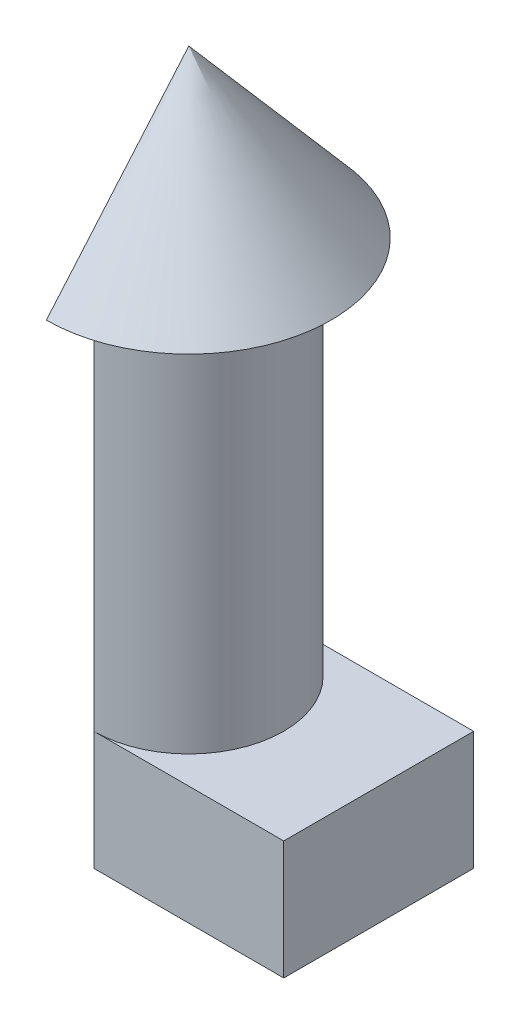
ISO-10303-21;
HEADER;
FILE_DESCRIPTION(('STEP AP214'),'2;1');
FILE_NAME('part.step','',(''),(''),'','','');
FILE_SCHEMA(('AUTOMOTIVE_DESIGN { 1 0 10303 214 1 1 1 1 }'));
ENDSEC;
DATA;
#1=APPLICATION_CONTEXT('core data for automotive mechanical design processes');
#2=APPLICATION_PROTOCOL_DEFINITION('international standard','automotive_design',2000,#1);
#3=PRODUCT_CONTEXT('',#1,'mechanical');
#4=PRODUCT('Part','Part','',(#3));
#5=PRODUCT_RELATED_PRODUCT_CATEGORY('part','',(#4));
#6=PRODUCT_DEFINITION_FORMATION('','',#4);
#7=PRODUCT_DEFINITION_CONTEXT('part definition',#1,'design');
#8=PRODUCT_DEFINITION('design','',#6,#7);
#9=PRODUCT_DEFINITION_SHAPE('','',#8);
#10=(LENGTH_UNIT() NAMED_UNIT(*) SI_UNIT(.MILLI.,.METRE.));
#11=(NAMED_UNIT(*) PLANE_ANGLE_UNIT() SI_UNIT($,.RADIAN.));
#12=(NAMED_UNIT(*) SI_UNIT($,.STERADIAN.) SOLID_ANGLE_UNIT());
#13=UNCERTAINTY_MEASURE_WITH_UNIT(LENGTH_MEASURE(1.E-05),#10,'distance_accuracy_value','');
#14=(GEOMETRIC_REPRESENTATION_CONTEXT(3) GLOBAL_UNCERTAINTY_ASSIGNED_CONTEXT((#13)) GLOBAL_UNIT_ASSIGNED_CONTEXT((#10,
#11,#12)) REPRESENTATION_CONTEXT('',''));
#15=CARTESIAN_POINT('',(0.,0.,0.));
#16=DIRECTION('',(0.,0.,1.));
#17=DIRECTION('',(1.,0.,0.));
#18=AXIS2_PLACEMENT_3D('',#15,#16,#17);
#19=CARTESIAN_POINT('',(0.,23.,0.));
#20=DIRECTION('',(0.,1.,0.));
#21=DIRECTION('',(-1.,0.,0.));
#22=AXIS2_PLACEMENT_3D('',#19,#20,#21);
#23=CYLINDRICAL_SURFACE('',#22,4.);
#24=DIRECTION('',(0.,1.,0.));
#25=VECTOR('',#24,1.);
#26=CARTESIAN_POINT('',(0.,23.,4.));
#27=LINE('',#26,#25);
#28=CARTESIAN_POINT('',(0.,0.,4.));
#29=VERTEX_POINT('',#28);
#30=CARTESIAN_POINT('',(0.,16.,4.));
#31=VERTEX_POINT('',#30);
#32=EDGE_CURVE('E122',#29,#31,#27,.T.);
#33=ORIENTED_EDGE('',*,*,#32,.F.);
#34=CARTESIAN_POINT('',(0.,0.,0.));
#35=DIRECTION('',(0.,1.,0.));
#36=DIRECTION('',(-1.,0.,0.));
#37=AXIS2_PLACEMENT_3D('',#34,#35,#36);
#38=CIRCLE('',#37,4.);
#39=CARTESIAN_POINT('',(0.,0.,-4.));
#40=VERTEX_POINT('',#39);
#41=EDGE_CURVE('E130',#29,#40,#38,.T.);
#42=ORIENTED_EDGE('',*,*,#41,.T.);
#43=DIRECTION('',(0.,1.,0.));
#44=VECTOR('',#43,1.);
#45=CARTESIAN_POINT('',(0.,23.,-4.));
#46=LINE('',#45,#44);
#47=CARTESIAN_POINT('',(0.,16.,-4.));
#48=VERTEX_POINT('',#47);
#49=EDGE_CURVE('E120',#48,#40,#46,.F.);
#50=ORIENTED_EDGE('',*,*,#49,.F.);
#51=CARTESIAN_POINT('',(0.,16.,0.));
#52=DIRECTION('',(0.,1.,0.));
#53=DIRECTION('',(-1.,0.,0.));
#54=AXIS2_PLACEMENT_3D('',#51,#52,#53);
#55=CIRCLE('',#54,4.);
#56=EDGE_CURVE('E127',#31,#48,#55,.T.);
#57=ORIENTED_EDGE('',*,*,#56,.F.);
#58=EDGE_LOOP('',(#33,#42,#50,#57));
#59=FACE_BOUND('',#58,.T.);
#60=ADVANCED_FACE('F35',(#59),#23,.T.);
#61=CARTESIAN_POINT('',(4.,16.,0.));
#62=DIRECTION('',(0.,1.,0.));
#63=DIRECTION('',(-1.,0.,0.));
#64=AXIS2_PLACEMENT_3D('',#61,#62,#63);
#65=PLANE('',#64);
#66=DIRECTION('',(0.,0.,1.));
#67=VECTOR('',#66,1.);
#68=CARTESIAN_POINT('',(0.,16.,0.));
#69=LINE('',#68,#67);
#70=CARTESIAN_POINT('',(0.,16.,-6.));
#71=VERTEX_POINT('',#70);
#72=EDGE_CURVE('E55',#71,#48,#69,.T.);
#73=ORIENTED_EDGE('',*,*,#72,.F.);
#74=CARTESIAN_POINT('',(0.,16.,0.));
#75=DIRECTION('',(0.,1.,0.));
#76=DIRECTION('',(-1.,0.,0.));
#77=AXIS2_PLACEMENT_3D('',#74,#75,#76);
#78=CIRCLE('',#77,6.);
#79=CARTESIAN_POINT('',(0.,16.,6.));
#80=VERTEX_POINT('',#79);
#81=EDGE_CURVE('E124',#80,#71,#78,.T.);
#82=ORIENTED_EDGE('',*,*,#81,.F.);
#83=EDGE_CURVE('E49',#31,#80,#69,.T.);
#84=ORIENTED_EDGE('',*,*,#83,.F.);
#85=ORIENTED_EDGE('',*,*,#56,.T.);
#86=EDGE_LOOP('',(#73,#82,#84,#85));
#87=FACE_BOUND('',#86,.T.);
#88=ADVANCED_FACE('F137',(#87),#65,.F.);
#89=CARTESIAN_POINT('',(0.,16.,0.));
#90=DIRECTION('',(0.,-1.,0.));
#91=DIRECTION('',(1.,0.,0.));
#92=AXIS2_PLACEMENT_3D('',#89,#90,#91);
#93=CONICAL_SURFACE('',#92,6.,0.70862627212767);
#94=DIRECTION('',(0.,-0.759256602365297,-0.650791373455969));
#95=VECTOR('',#94,1.);
#96=CARTESIAN_POINT('',(0.,23.,0.));
#97=LINE('',#96,#95);
#98=CARTESIAN_POINT('',(0.,23.,0.));
#99=VERTEX_POINT('',#98);
#100=EDGE_CURVE('E11',#99,#71,#97,.T.);
#101=ORIENTED_EDGE('',*,*,#100,.F.);
#102=DIRECTION('',(0.,0.759256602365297,-0.650791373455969));
#103=VECTOR('',#102,1.);
#104=CARTESIAN_POINT('',(0.,23.,0.));
#105=LINE('',#104,#103);
#106=EDGE_CURVE('E42',#80,#99,#105,.T.);
#107=ORIENTED_EDGE('',*,*,#106,.F.);
#108=ORIENTED_EDGE('',*,*,#81,.T.);
#109=EDGE_LOOP('',(#101,#107,#108));
#110=FACE_BOUND('',#109,.T.);
#111=ADVANCED_FACE('F135',(#110),#93,.T.);
#112=CARTESIAN_POINT('',(0.,0.,10.));
#113=DIRECTION('',(-1.,0.,0.));
#114=DIRECTION('',(0.,0.,1.));
#115=AXIS2_PLACEMENT_3D('',#112,#113,#114);
#116=PLANE('',#115);
#117=ORIENTED_EDGE('',*,*,#32,.T.);
#118=ORIENTED_EDGE('',*,*,#83,.T.);
#119=ORIENTED_EDGE('',*,*,#106,.T.);
#120=ORIENTED_EDGE('',*,*,#100,.T.);
#121=ORIENTED_EDGE('',*,*,#72,.T.);
#122=ORIENTED_EDGE('',*,*,#49,.T.);
#123=DIRECTION('',(0.,1.,0.));
#124=VECTOR('',#123,1.);
#125=CARTESIAN_POINT('',(0.,-5.,-4.));
#126=LINE('',#125,#124);
#127=CARTESIAN_POINT('',(0.,-5.,-4.));
#128=VERTEX_POINT('',#127);
#129=EDGE_CURVE('E95',#128,#40,#126,.T.);
#130=ORIENTED_EDGE('',*,*,#129,.F.);
#131=DIRECTION('',(0.,0.,-1.));
#132=VECTOR('',#131,1.);
#133=CARTESIAN_POINT('',(0.,-5.,4.));
#134=LINE('',#133,#132);
#135=CARTESIAN_POINT('',(0.,-5.,4.));
#136=VERTEX_POINT('',#135);
#137=EDGE_CURVE('E88',#136,#128,#134,.T.);
#138=ORIENTED_EDGE('',*,*,#137,.F.);
#139=DIRECTION('',(0.,1.,0.));
#140=VECTOR('',#139,1.);
#141=CARTESIAN_POINT('',(0.,-5.,4.));
#142=LINE('',#141,#140);
#143=EDGE_CURVE('E92',#136,#29,#142,.T.);
#144=ORIENTED_EDGE('',*,*,#143,.T.);
#145=EDGE_LOOP('',(#117,#118,#119,#120,#121,#122,#130,#138,#144));
#146=FACE_BOUND('',#145,.T.);
#147=ADVANCED_FACE('F90',(#146),#116,.T.);
#148=CARTESIAN_POINT('',(8.,-5.,4.));
#149=DIRECTION('',(0.,0.,-1.));
#150=DIRECTION('',(-1.,0.,0.));
#151=AXIS2_PLACEMENT_3D('',#148,#149,#150);
#152=PLANE('',#151);
#153=DIRECTION('',(-1.,0.,0.));
#154=VECTOR('',#153,1.);
#155=CARTESIAN_POINT('',(8.,0.,4.));
#156=LINE('',#155,#154);
#157=CARTESIAN_POINT('',(8.,0.,4.));
#158=VERTEX_POINT('',#157);
#159=EDGE_CURVE('E112',#158,#29,#156,.T.);
#160=ORIENTED_EDGE('',*,*,#159,.T.);
#161=ORIENTED_EDGE('',*,*,#143,.F.);
#162=DIRECTION('',(-1.,0.,0.));
#163=VECTOR('',#162,1.);
#164=CARTESIAN_POINT('',(8.,-5.,4.));
#165=LINE('',#164,#163);
#166=CARTESIAN_POINT('',(8.,-5.,4.));
#167=VERTEX_POINT('',#166);
#168=EDGE_CURVE('E99',#167,#136,#165,.T.);
#169=ORIENTED_EDGE('',*,*,#168,.F.);
#170=DIRECTION('',(0.,1.,0.));
#171=VECTOR('',#170,1.);
#172=CARTESIAN_POINT('',(8.,-5.,4.));
#173=LINE('',#172,#171);
#174=EDGE_CURVE('E150',#167,#158,#173,.T.);
#175=ORIENTED_EDGE('',*,*,#174,.T.);
#176=EDGE_LOOP('',(#160,#161,#169,#175));
#177=FACE_BOUND('',#176,.T.);
#178=ADVANCED_FACE('F110',(#177),#152,.F.);
#179=CARTESIAN_POINT('',(0.,-5.,-4.));
#180=DIRECTION('',(0.,0.,1.));
#181=DIRECTION('',(1.,0.,0.));
#182=AXIS2_PLACEMENT_3D('',#179,#180,#181);
#183=PLANE('',#182);
#184=DIRECTION('',(1.,0.,0.));
#185=VECTOR('',#184,1.);
#186=CARTESIAN_POINT('',(0.,0.,-4.));
#187=LINE('',#186,#185);
#188=CARTESIAN_POINT('',(8.,0.,-4.));
#189=VERTEX_POINT('',#188);
#190=EDGE_CURVE('E143',#40,#189,#187,.T.);
#191=ORIENTED_EDGE('',*,*,#190,.T.);
#192=DIRECTION('',(0.,1.,0.));
#193=VECTOR('',#192,1.);
#194=CARTESIAN_POINT('',(8.,-5.,-4.));
#195=LINE('',#194,#193);
#196=CARTESIAN_POINT('',(8.,-5.,-4.));
#197=VERTEX_POINT('',#196);
#198=EDGE_CURVE('E116',#197,#189,#195,.T.);
#199=ORIENTED_EDGE('',*,*,#198,.F.);
#200=DIRECTION('',(1.,0.,0.));
#201=VECTOR('',#200,1.);
#202=CARTESIAN_POINT('',(0.,-5.,-4.));
#203=LINE('',#202,#201);
#204=EDGE_CURVE('E98',#128,#197,#203,.T.);
#205=ORIENTED_EDGE('',*,*,#204,.F.);
#206=ORIENTED_EDGE('',*,*,#129,.T.);
#207=EDGE_LOOP('',(#191,#199,#205,#206));
#208=FACE_BOUND('',#207,.T.);
#209=ADVANCED_FACE('F148',(#208),#183,.F.);
#210=CARTESIAN_POINT('',(8.,-5.,-4.));
#211=DIRECTION('',(-1.,0.,0.));
#212=DIRECTION('',(0.,-1.,0.));
#213=AXIS2_PLACEMENT_3D('',#210,#211,#212);
#214=PLANE('',#213);
#215=DIRECTION('',(0.,0.,1.));
#216=VECTOR('',#215,1.);
#217=CARTESIAN_POINT('',(8.,0.,-4.));
#218=LINE('',#217,#216);
#219=EDGE_CURVE('E108',#189,#158,#218,.T.);
#220=ORIENTED_EDGE('',*,*,#219,.T.);
#221=ORIENTED_EDGE('',*,*,#174,.F.);
#222=DIRECTION('',(0.,0.,1.));
#223=VECTOR('',#222,1.);
#224=CARTESIAN_POINT('',(8.,-5.,-4.));
#225=LINE('',#224,#223);
#226=EDGE_CURVE('E104',#197,#167,#225,.T.);
#227=ORIENTED_EDGE('',*,*,#226,.F.);
#228=ORIENTED_EDGE('',*,*,#198,.T.);
#229=EDGE_LOOP('',(#220,#221,#227,#228));
#230=FACE_BOUND('',#229,.T.);
#231=ADVANCED_FACE('F156',(#230),#214,.F.);
#232=CARTESIAN_POINT('',(0.,-5.,0.));
#233=DIRECTION('',(0.,-1.,0.));
#234=DIRECTION('',(1.,0.,0.));
#235=AXIS2_PLACEMENT_3D('',#232,#233,#234);
#236=PLANE('',#235);
#237=ORIENTED_EDGE('',*,*,#168,.T.);
#238=ORIENTED_EDGE('',*,*,#137,.T.);
#239=ORIENTED_EDGE('',*,*,#204,.T.);
#240=ORIENTED_EDGE('',*,*,#226,.T.);
#241=EDGE_LOOP('',(#237,#238,#239,#240));
#242=FACE_BOUND('',#241,.T.);
#243=ADVANCED_FACE('F102',(#242),#236,.T.);
#244=CARTESIAN_POINT('',(0.,0.,0.));
#245=DIRECTION('',(0.,-1.,0.));
#246=DIRECTION('',(1.,0.,0.));
#247=AXIS2_PLACEMENT_3D('',#244,#245,#246);
#248=PLANE('',#247);
#249=ORIENTED_EDGE('',*,*,#41,.F.);
#250=ORIENTED_EDGE('',*,*,#159,.F.);
#251=ORIENTED_EDGE('',*,*,#219,.F.);
#252=ORIENTED_EDGE('',*,*,#190,.F.);
#253=EDGE_LOOP('',(#249,#250,#251,#252));
#254=FACE_BOUND('',#253,.T.);
#255=ADVANCED_FACE('F141',(#254),#248,.F.);
#256=CLOSED_SHELL('',(#60,#88,#111,#147,#178,#209,#231,#243,#255));
#257=MANIFOLD_SOLID_BREP('B2',#256);
#258=ADVANCED_BREP_SHAPE_REPRESENTATION('',(#18,#257),#14);
#259=SHAPE_DEFINITION_REPRESENTATION(#9,#258);
ENDSEC;
END-ISO-10303-21;
